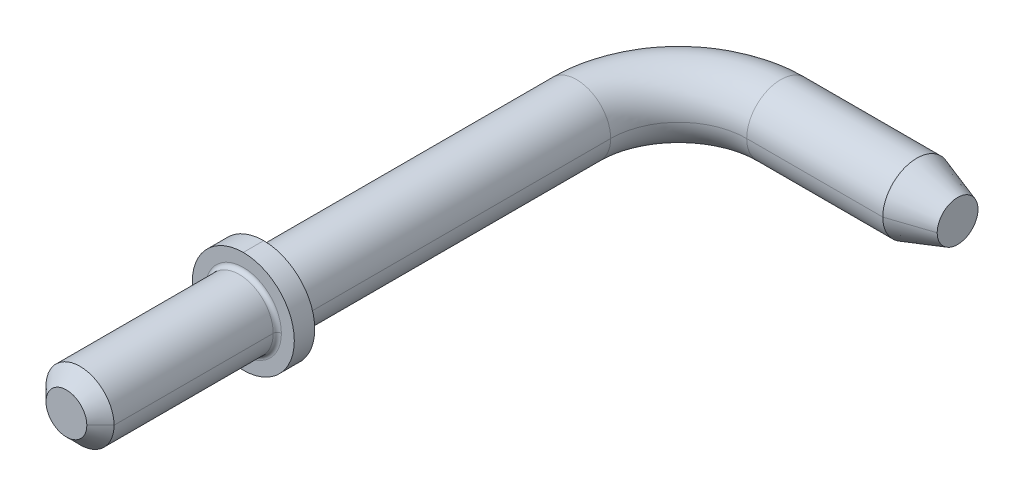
ISO-10303-21;
HEADER;
FILE_DESCRIPTION(('STEP AP214'),'2;1');
FILE_NAME('part.step','',(''),(''),'','','');
FILE_SCHEMA(('AUTOMOTIVE_DESIGN { 1 0 10303 214 1 1 1 1 }'));
ENDSEC;
DATA;
#1=APPLICATION_CONTEXT('core data for automotive mechanical design processes');
#2=APPLICATION_PROTOCOL_DEFINITION('international standard','automotive_design',2000,#1);
#3=PRODUCT_CONTEXT('',#1,'mechanical');
#4=PRODUCT('Part','Part','',(#3));
#5=PRODUCT_RELATED_PRODUCT_CATEGORY('part','',(#4));
#6=PRODUCT_DEFINITION_FORMATION('','',#4);
#7=PRODUCT_DEFINITION_CONTEXT('part definition',#1,'design');
#8=PRODUCT_DEFINITION('design','',#6,#7);
#9=PRODUCT_DEFINITION_SHAPE('','',#8);
#10=(LENGTH_UNIT() NAMED_UNIT(*) SI_UNIT(.MILLI.,.METRE.));
#11=(NAMED_UNIT(*) PLANE_ANGLE_UNIT() SI_UNIT($,.RADIAN.));
#12=(NAMED_UNIT(*) SI_UNIT($,.STERADIAN.) SOLID_ANGLE_UNIT());
#13=UNCERTAINTY_MEASURE_WITH_UNIT(LENGTH_MEASURE(1.E-05),#10,'distance_accuracy_value','');
#14=(GEOMETRIC_REPRESENTATION_CONTEXT(3) GLOBAL_UNCERTAINTY_ASSIGNED_CONTEXT((#13)) GLOBAL_UNIT_ASSIGNED_CONTEXT((#10,
#11,#12)) REPRESENTATION_CONTEXT('',''));
#15=CARTESIAN_POINT('',(0.,0.,0.));
#16=DIRECTION('',(0.,0.,1.));
#17=DIRECTION('',(1.,0.,0.));
#18=AXIS2_PLACEMENT_3D('',#15,#16,#17);
#19=CARTESIAN_POINT('',(0.,0.,14.5));
#20=DIRECTION('',(0.,0.,-1.));
#21=DIRECTION('',(1.,0.,0.));
#22=AXIS2_PLACEMENT_3D('',#19,#20,#21);
#23=PLANE('',#22);
#24=CARTESIAN_POINT('',(0.,0.,14.5000000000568));
#25=DIRECTION('',(0.,0.,-1.));
#26=DIRECTION('',(1.,0.,0.));
#27=AXIS2_PLACEMENT_3D('',#24,#25,#26);
#28=CIRCLE('',#27,1.49999999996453);
#29=CARTESIAN_POINT('',(1.49999999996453,0.,14.5000000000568));
#30=VERTEX_POINT('',#29);
#31=CARTESIAN_POINT('',(-1.49999999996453,0.,14.5000000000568));
#32=VERTEX_POINT('',#31);
#33=EDGE_CURVE('E17',#30,#32,#28,.T.);
#34=ORIENTED_EDGE('',*,*,#33,.F.);
#35=CARTESIAN_POINT('',(0.,0.,14.5000000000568));
#36=DIRECTION('',(0.,0.,-1.));
#37=DIRECTION('',(1.,0.,0.));
#38=AXIS2_PLACEMENT_3D('',#35,#36,#37);
#39=CIRCLE('',#38,1.49999999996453);
#40=EDGE_CURVE('E97',#32,#30,#39,.T.);
#41=ORIENTED_EDGE('',*,*,#40,.F.);
#42=EDGE_LOOP('',(#34,#41));
#43=FACE_BOUND('',#42,.T.);
#44=ADVANCED_FACE('F14',(#43),#23,.F.);
#45=CARTESIAN_POINT('',(0.,0.,13.5000000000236));
#46=DIRECTION('',(0.,0.,-1.));
#47=DIRECTION('',(1.,0.,0.));
#48=AXIS2_PLACEMENT_3D('',#45,#46,#47);
#49=CONICAL_SURFACE('',#48,2.49999999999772,0.785398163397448);
#50=DIRECTION('',(-0.707106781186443,0.,0.707106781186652));
#51=VECTOR('',#50,1.);
#52=CARTESIAN_POINT('',(499000.,0.,-498984.000000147));
#53=LINE('',#52,#51);
#54=CARTESIAN_POINT('',(2.49999999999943,0.,13.5000000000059));
#55=VERTEX_POINT('',#54);
#56=EDGE_CURVE('E95',#30,#55,#53,.F.);
#57=ORIENTED_EDGE('',*,*,#56,.F.);
#58=ORIENTED_EDGE('',*,*,#33,.T.);
#59=DIRECTION('',(0.707106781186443,0.,0.707106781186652));
#60=VECTOR('',#59,1.);
#61=CARTESIAN_POINT('',(-499000.,-6.11078570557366E-11,-498984.000000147));
#62=LINE('',#61,#60);
#63=CARTESIAN_POINT('',(-2.49999999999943,0.,13.5000000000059));
#64=VERTEX_POINT('',#63);
#65=EDGE_CURVE('E92',#64,#32,#62,.T.);
#66=ORIENTED_EDGE('',*,*,#65,.F.);
#67=CARTESIAN_POINT('',(0.,0.,13.5));
#68=DIRECTION('',(0.,0.,-1.));
#69=DIRECTION('',(1.,0.,0.));
#70=AXIS2_PLACEMENT_3D('',#67,#68,#69);
#71=CIRCLE('',#70,2.5);
#72=EDGE_CURVE('E99',#55,#64,#71,.T.);
#73=ORIENTED_EDGE('',*,*,#72,.F.);
#74=EDGE_LOOP('',(#57,#58,#66,#73));
#75=FACE_BOUND('',#74,.T.);
#76=ADVANCED_FACE('F90',(#75),#49,.T.);
#77=CARTESIAN_POINT('',(0.,0.,13.5000000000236));
#78=DIRECTION('',(0.,0.,-1.));
#79=DIRECTION('',(1.,0.,0.));
#80=AXIS2_PLACEMENT_3D('',#77,#78,#79);
#81=CONICAL_SURFACE('',#80,2.49999999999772,0.785398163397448);
#82=ORIENTED_EDGE('',*,*,#65,.T.);
#83=ORIENTED_EDGE('',*,*,#40,.T.);
#84=ORIENTED_EDGE('',*,*,#56,.T.);
#85=CARTESIAN_POINT('',(0.,0.,13.5));
#86=DIRECTION('',(0.,0.,-1.));
#87=DIRECTION('',(1.,0.,0.));
#88=AXIS2_PLACEMENT_3D('',#85,#86,#87);
#89=CIRCLE('',#88,2.5);
#90=EDGE_CURVE('E103',#64,#55,#89,.T.);
#91=ORIENTED_EDGE('',*,*,#90,.F.);
#92=EDGE_LOOP('',(#82,#83,#84,#91));
#93=FACE_BOUND('',#92,.T.);
#94=ADVANCED_FACE('F101',(#93),#81,.T.);
#95=CARTESIAN_POINT('',(0.,0.,14.5));
#96=DIRECTION('',(0.,0.,-1.));
#97=DIRECTION('',(1.,0.,0.));
#98=AXIS2_PLACEMENT_3D('',#95,#96,#97);
#99=CYLINDRICAL_SURFACE('',#98,2.5);
#100=DIRECTION('',(0.,0.,-1.));
#101=VECTOR('',#100,1.);
#102=CARTESIAN_POINT('',(-2.5,0.,14.5));
#103=LINE('',#102,#101);
#104=CARTESIAN_POINT('',(-2.5,0.,1.8));
#105=VERTEX_POINT('',#104);
#106=EDGE_CURVE('E189',#105,#64,#103,.F.);
#107=ORIENTED_EDGE('',*,*,#106,.F.);
#108=CARTESIAN_POINT('',(0.,0.,1.8));
#109=DIRECTION('',(0.,0.,-1.));
#110=DIRECTION('',(0.99939718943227,0.034716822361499,0.));
#111=AXIS2_PLACEMENT_3D('',#108,#109,#110);
#112=CIRCLE('',#111,2.5);
#113=CARTESIAN_POINT('',(2.5,0.,1.8));
#114=VERTEX_POINT('',#113);
#115=EDGE_CURVE('E171',#105,#114,#112,.F.);
#116=ORIENTED_EDGE('',*,*,#115,.T.);
#117=DIRECTION('',(0.,0.,-1.));
#118=VECTOR('',#117,1.);
#119=CARTESIAN_POINT('',(2.5,0.,14.5));
#120=LINE('',#119,#118);
#121=EDGE_CURVE('E178',#55,#114,#120,.T.);
#122=ORIENTED_EDGE('',*,*,#121,.F.);
#123=ORIENTED_EDGE('',*,*,#72,.T.);
#124=EDGE_LOOP('',(#107,#116,#122,#123));
#125=FACE_BOUND('',#124,.T.);
#126=ADVANCED_FACE('F201',(#125),#99,.T.);
#127=CARTESIAN_POINT('',(0.,0.,14.5));
#128=DIRECTION('',(0.,0.,-1.));
#129=DIRECTION('',(1.,0.,0.));
#130=AXIS2_PLACEMENT_3D('',#127,#128,#129);
#131=CYLINDRICAL_SURFACE('',#130,2.5);
#132=ORIENTED_EDGE('',*,*,#121,.T.);
#133=CARTESIAN_POINT('',(0.,0.,1.8));
#134=DIRECTION('',(0.,0.,-1.));
#135=DIRECTION('',(-0.99939718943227,-0.034716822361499,0.));
#136=AXIS2_PLACEMENT_3D('',#133,#134,#135);
#137=CIRCLE('',#136,2.5);
#138=EDGE_CURVE('E146',#114,#105,#137,.F.);
#139=ORIENTED_EDGE('',*,*,#138,.T.);
#140=ORIENTED_EDGE('',*,*,#106,.T.);
#141=ORIENTED_EDGE('',*,*,#90,.T.);
#142=EDGE_LOOP('',(#132,#139,#140,#141));
#143=FACE_BOUND('',#142,.T.);
#144=ADVANCED_FACE('F163',(#143),#131,.T.);
#145=CARTESIAN_POINT('',(0.,0.,1.8));
#146=DIRECTION('',(0.,0.,-1.));
#147=DIRECTION('',(0.99939718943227,0.034716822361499,0.));
#148=AXIS2_PLACEMENT_3D('',#145,#146,#147);
#149=TOROIDAL_SURFACE('',#148,2.8,0.3);
#150=CARTESIAN_POINT('',(0.,0.,1.50000000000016));
#151=DIRECTION('',(0.,0.,1.));
#152=DIRECTION('',(-1.,0.,0.));
#153=AXIS2_PLACEMENT_3D('',#150,#151,#152);
#154=CIRCLE('',#153,2.7999996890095);
#155=CARTESIAN_POINT('',(2.7999995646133,0.,1.5000000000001));
#156=VERTEX_POINT('',#155);
#157=CARTESIAN_POINT('',(-2.7999995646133,0.,1.5000000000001));
#158=VERTEX_POINT('',#157);
#159=EDGE_CURVE('E132',#156,#158,#154,.F.);
#160=ORIENTED_EDGE('',*,*,#159,.F.);
#161=CARTESIAN_POINT('',(2.8,0.,1.8));
#162=DIRECTION('',(0.,-1.,0.));
#163=DIRECTION('',(1.,0.,0.));
#164=AXIS2_PLACEMENT_3D('',#161,#162,#163);
#165=CIRCLE('',#164,0.3);
#166=EDGE_CURVE('E133',#156,#114,#165,.F.);
#167=ORIENTED_EDGE('',*,*,#166,.T.);
#168=ORIENTED_EDGE('',*,*,#115,.F.);
#169=CARTESIAN_POINT('',(-2.8,0.,1.8));
#170=DIRECTION('',(0.,1.,0.));
#171=DIRECTION('',(-1.,0.,0.));
#172=AXIS2_PLACEMENT_3D('',#169,#170,#171);
#173=CIRCLE('',#172,0.3);
#174=EDGE_CURVE('E140',#105,#158,#173,.T.);
#175=ORIENTED_EDGE('',*,*,#174,.T.);
#176=EDGE_LOOP('',(#160,#167,#168,#175));
#177=FACE_BOUND('',#176,.T.);
#178=ADVANCED_FACE('F157',(#177),#149,.F.);
#179=CARTESIAN_POINT('',(0.,0.,1.8));
#180=DIRECTION('',(0.,0.,-1.));
#181=DIRECTION('',(-0.99939718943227,-0.034716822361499,0.));
#182=AXIS2_PLACEMENT_3D('',#179,#180,#181);
#183=TOROIDAL_SURFACE('',#182,2.8,0.3);
#184=CARTESIAN_POINT('',(0.,0.,1.50000000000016));
#185=DIRECTION('',(0.,0.,1.));
#186=DIRECTION('',(1.,0.,0.));
#187=AXIS2_PLACEMENT_3D('',#184,#185,#186);
#188=CIRCLE('',#187,2.7999996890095);
#189=EDGE_CURVE('E138',#158,#156,#188,.F.);
#190=ORIENTED_EDGE('',*,*,#189,.F.);
#191=ORIENTED_EDGE('',*,*,#174,.F.);
#192=ORIENTED_EDGE('',*,*,#138,.F.);
#193=ORIENTED_EDGE('',*,*,#166,.F.);
#194=EDGE_LOOP('',(#190,#191,#192,#193));
#195=FACE_BOUND('',#194,.T.);
#196=ADVANCED_FACE('F162',(#195),#183,.F.);
#197=CARTESIAN_POINT('',(20.5,0.,-30.499999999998));
#198=DIRECTION('',(1.,0.,0.));
#199=DIRECTION('',(0.,1.,0.));
#200=AXIS2_PLACEMENT_3D('',#197,#198,#199);
#201=PLANE('',#200);
#202=CARTESIAN_POINT('',(20.49999999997,0.,-30.499999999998));
#203=DIRECTION('',(-1.,0.,0.));
#204=DIRECTION('',(0.,-1.,0.));
#205=AXIS2_PLACEMENT_3D('',#202,#203,#204);
#206=CIRCLE('',#205,1.50000000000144);
#207=CARTESIAN_POINT('',(20.49999999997,0.,-28.9999999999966));
#208=VERTEX_POINT('',#207);
#209=CARTESIAN_POINT('',(20.49999999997,0.,-32.0000000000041));
#210=VERTEX_POINT('',#209);
#211=EDGE_CURVE('E127',#208,#210,#206,.T.);
#212=ORIENTED_EDGE('',*,*,#211,.F.);
#213=CARTESIAN_POINT('',(20.49999999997,0.,-30.499999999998));
#214=DIRECTION('',(-1.,0.,0.));
#215=DIRECTION('',(0.,-1.,0.));
#216=AXIS2_PLACEMENT_3D('',#213,#214,#215);
#217=CIRCLE('',#216,1.50000000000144);
#218=EDGE_CURVE('E131',#210,#208,#217,.T.);
#219=ORIENTED_EDGE('',*,*,#218,.F.);
#220=EDGE_LOOP('',(#212,#219));
#221=FACE_BOUND('',#220,.T.);
#222=ADVANCED_FACE('F446',(#221),#201,.T.);
#223=CARTESIAN_POINT('',(17.5000000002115,0.,-30.499999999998));
#224=DIRECTION('',(-1.,0.,0.));
#225=DIRECTION('',(0.,-1.,0.));
#226=AXIS2_PLACEMENT_3D('',#223,#224,#225);
#227=CONICAL_SURFACE('',#226,2.49999999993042,0.321750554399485);
#228=DIRECTION('',(0.948683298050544,0.,0.316227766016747));
#229=VECTOR('',#228,1.);
#230=CARTESIAN_POINT('',(-499000.,0.,-166372.166666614));
#231=LINE('',#230,#229);
#232=CARTESIAN_POINT('',(17.5000000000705,0.,-32.9999999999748));
#233=VERTEX_POINT('',#232);
#234=EDGE_CURVE('E209',#210,#233,#231,.F.);
#235=ORIENTED_EDGE('',*,*,#234,.F.);
#236=ORIENTED_EDGE('',*,*,#218,.T.);
#237=DIRECTION('',(0.948683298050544,0.,-0.316227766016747));
#238=VECTOR('',#237,1.);
#239=CARTESIAN_POINT('',(-499000.,-2.03703061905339E-11,166311.166666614));
#240=LINE('',#239,#238);
#241=CARTESIAN_POINT('',(17.5000000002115,0.,-28.0000000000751));
#242=VERTEX_POINT('',#241);
#243=EDGE_CURVE('E130',#242,#208,#240,.T.);
#244=ORIENTED_EDGE('',*,*,#243,.F.);
#245=CARTESIAN_POINT('',(17.5,0.,-30.499999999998));
#246=DIRECTION('',(1.,0.,0.));
#247=DIRECTION('',(0.,1.,0.));
#248=AXIS2_PLACEMENT_3D('',#245,#246,#247);
#249=CIRCLE('',#248,2.5);
#250=EDGE_CURVE('E126',#233,#242,#249,.F.);
#251=ORIENTED_EDGE('',*,*,#250,.F.);
#252=EDGE_LOOP('',(#235,#236,#244,#251));
#253=FACE_BOUND('',#252,.T.);
#254=ADVANCED_FACE('F232',(#253),#227,.T.);
#255=CARTESIAN_POINT('',(0.,0.,1.5));
#256=DIRECTION('',(0.,0.,1.));
#257=DIRECTION('',(-1.,0.,0.));
#258=AXIS2_PLACEMENT_3D('',#255,#256,#257);
#259=PLANE('',#258);
#260=ORIENTED_EDGE('',*,*,#159,.T.);
#261=ORIENTED_EDGE('',*,*,#189,.T.);
#262=EDGE_LOOP('',(#260,#261));
#263=FACE_BOUND('',#262,.T.);
#264=CARTESIAN_POINT('',(0.,0.,1.5));
#265=DIRECTION('',(0.,0.,1.));
#266=DIRECTION('',(-1.,0.,0.));
#267=AXIS2_PLACEMENT_3D('',#264,#265,#266);
#268=CIRCLE('',#267,3.75);
#269=CARTESIAN_POINT('',(0.,3.75,1.5));
#270=VERTEX_POINT('',#269);
#271=CARTESIAN_POINT('',(0.,-3.75,1.5));
#272=VERTEX_POINT('',#271);
#273=EDGE_CURVE('E124',#270,#272,#268,.F.);
#274=ORIENTED_EDGE('',*,*,#273,.F.);
#275=CARTESIAN_POINT('',(0.,0.,1.5));
#276=DIRECTION('',(0.,0.,1.));
#277=DIRECTION('',(-1.,0.,0.));
#278=AXIS2_PLACEMENT_3D('',#275,#276,#277);
#279=CIRCLE('',#278,3.75);
#280=EDGE_CURVE('E119',#272,#270,#279,.F.);
#281=ORIENTED_EDGE('',*,*,#280,.F.);
#282=EDGE_LOOP('',(#274,#281));
#283=FACE_BOUND('',#282,.T.);
#284=ADVANCED_FACE('F212',(#263,#283),#259,.T.);
#285=CARTESIAN_POINT('',(17.5000000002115,0.,-30.499999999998));
#286=DIRECTION('',(-1.,0.,0.));
#287=DIRECTION('',(0.,-1.,0.));
#288=AXIS2_PLACEMENT_3D('',#285,#286,#287);
#289=CONICAL_SURFACE('',#288,2.49999999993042,0.321750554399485);
#290=ORIENTED_EDGE('',*,*,#243,.T.);
#291=ORIENTED_EDGE('',*,*,#211,.T.);
#292=ORIENTED_EDGE('',*,*,#234,.T.);
#293=CARTESIAN_POINT('',(17.5,0.,-30.499999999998));
#294=DIRECTION('',(1.,0.,0.));
#295=DIRECTION('',(0.,1.,0.));
#296=AXIS2_PLACEMENT_3D('',#293,#294,#295);
#297=CIRCLE('',#296,2.5);
#298=EDGE_CURVE('E255',#242,#233,#297,.F.);
#299=ORIENTED_EDGE('',*,*,#298,.F.);
#300=EDGE_LOOP('',(#290,#291,#292,#299));
#301=FACE_BOUND('',#300,.T.);
#302=ADVANCED_FACE('F231',(#301),#289,.T.);
#303=CARTESIAN_POINT('',(7.5,0.,-30.499999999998));
#304=DIRECTION('',(1.,0.,0.));
#305=DIRECTION('',(0.,1.,0.));
#306=AXIS2_PLACEMENT_3D('',#303,#304,#305);
#307=CYLINDRICAL_SURFACE('',#306,2.5);
#308=DIRECTION('',(1.,0.,0.));
#309=VECTOR('',#308,1.);
#310=CARTESIAN_POINT('',(7.5,0.,-27.999999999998));
#311=LINE('',#310,#309);
#312=CARTESIAN_POINT('',(7.5,0.,-27.999999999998));
#313=VERTEX_POINT('',#312);
#314=EDGE_CURVE('E259',#313,#242,#311,.T.);
#315=ORIENTED_EDGE('',*,*,#314,.F.);
#316=CARTESIAN_POINT('',(7.5,0.,-30.499999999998));
#317=DIRECTION('',(1.,0.,0.));
#318=DIRECTION('',(0.,0.,-1.));
#319=AXIS2_PLACEMENT_3D('',#316,#317,#318);
#320=CIRCLE('',#319,2.5);
#321=CARTESIAN_POINT('',(7.5,0.,-32.999999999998));
#322=VERTEX_POINT('',#321);
#323=EDGE_CURVE('E268',#322,#313,#320,.F.);
#324=ORIENTED_EDGE('',*,*,#323,.F.);
#325=DIRECTION('',(1.,0.,0.));
#326=VECTOR('',#325,1.);
#327=CARTESIAN_POINT('',(7.5,0.,-32.999999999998));
#328=LINE('',#327,#326);
#329=EDGE_CURVE('E258',#233,#322,#328,.F.);
#330=ORIENTED_EDGE('',*,*,#329,.F.);
#331=ORIENTED_EDGE('',*,*,#250,.T.);
#332=EDGE_LOOP('',(#315,#324,#330,#331));
#333=FACE_BOUND('',#332,.T.);
#334=ADVANCED_FACE('F396',(#333),#307,.T.);
#335=CARTESIAN_POINT('',(0.,0.,-0.0750000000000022));
#336=DIRECTION('',(0.,0.,1.));
#337=DIRECTION('',(-1.,0.,0.));
#338=AXIS2_PLACEMENT_3D('',#335,#336,#337);
#339=CYLINDRICAL_SURFACE('',#338,3.75);
#340=CARTESIAN_POINT('',(0.,0.,0.));
#341=DIRECTION('',(0.,0.,1.));
#342=DIRECTION('',(-1.,0.,0.));
#343=AXIS2_PLACEMENT_3D('',#340,#341,#342);
#344=CIRCLE('',#343,3.75);
#345=CARTESIAN_POINT('',(0.,-3.75,0.));
#346=VERTEX_POINT('',#345);
#347=CARTESIAN_POINT('',(0.,3.75,0.));
#348=VERTEX_POINT('',#347);
#349=EDGE_CURVE('E116',#346,#348,#344,.T.);
#350=ORIENTED_EDGE('',*,*,#349,.T.);
#351=DIRECTION('',(0.,0.,1.));
#352=VECTOR('',#351,1.);
#353=CARTESIAN_POINT('',(0.,3.75,-0.0750000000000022));
#354=LINE('',#353,#352);
#355=EDGE_CURVE('E122',#270,#348,#354,.F.);
#356=ORIENTED_EDGE('',*,*,#355,.F.);
#357=ORIENTED_EDGE('',*,*,#273,.T.);
#358=DIRECTION('',(0.,0.,1.));
#359=VECTOR('',#358,1.);
#360=CARTESIAN_POINT('',(0.,-3.75,-0.0750000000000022));
#361=LINE('',#360,#359);
#362=EDGE_CURVE('E123',#346,#272,#361,.T.);
#363=ORIENTED_EDGE('',*,*,#362,.F.);
#364=EDGE_LOOP('',(#350,#356,#357,#363));
#365=FACE_BOUND('',#364,.T.);
#366=ADVANCED_FACE('F424',(#365),#339,.T.);
#367=CARTESIAN_POINT('',(0.,0.,-0.0750000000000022));
#368=DIRECTION('',(0.,0.,1.));
#369=DIRECTION('',(-1.,0.,0.));
#370=AXIS2_PLACEMENT_3D('',#367,#368,#369);
#371=CYLINDRICAL_SURFACE('',#370,3.75);
#372=ORIENTED_EDGE('',*,*,#280,.T.);
#373=ORIENTED_EDGE('',*,*,#355,.T.);
#374=CARTESIAN_POINT('',(0.,0.,0.));
#375=DIRECTION('',(0.,0.,1.));
#376=DIRECTION('',(-1.,0.,0.));
#377=AXIS2_PLACEMENT_3D('',#374,#375,#376);
#378=CIRCLE('',#377,3.75);
#379=EDGE_CURVE('E112',#348,#346,#378,.T.);
#380=ORIENTED_EDGE('',*,*,#379,.T.);
#381=ORIENTED_EDGE('',*,*,#362,.T.);
#382=EDGE_LOOP('',(#372,#373,#380,#381));
#383=FACE_BOUND('',#382,.T.);
#384=ADVANCED_FACE('F426',(#383),#371,.T.);
#385=CARTESIAN_POINT('',(7.5,0.,-30.499999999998));
#386=DIRECTION('',(1.,0.,0.));
#387=DIRECTION('',(0.,1.,0.));
#388=AXIS2_PLACEMENT_3D('',#385,#386,#387);
#389=CYLINDRICAL_SURFACE('',#388,2.5);
#390=ORIENTED_EDGE('',*,*,#329,.T.);
#391=CARTESIAN_POINT('',(7.5,0.,-30.499999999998));
#392=DIRECTION('',(1.,0.,0.));
#393=DIRECTION('',(0.,0.,-1.));
#394=AXIS2_PLACEMENT_3D('',#391,#392,#393);
#395=CIRCLE('',#394,2.5);
#396=EDGE_CURVE('E400',#313,#322,#395,.F.);
#397=ORIENTED_EDGE('',*,*,#396,.F.);
#398=ORIENTED_EDGE('',*,*,#314,.T.);
#399=ORIENTED_EDGE('',*,*,#298,.T.);
#400=EDGE_LOOP('',(#390,#397,#398,#399));
#401=FACE_BOUND('',#400,.T.);
#402=ADVANCED_FACE('F398',(#401),#389,.T.);
#403=CARTESIAN_POINT('',(7.5,0.,-22.999999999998));
#404=DIRECTION('',(0.,-1.,0.));
#405=DIRECTION('',(1.,0.,0.));
#406=AXIS2_PLACEMENT_3D('',#403,#404,#405);
#407=TOROIDAL_SURFACE('',#406,7.5,2.5);
#408=CARTESIAN_POINT('',(7.5,0.,-22.999999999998));
#409=DIRECTION('',(0.,-1.,0.));
#410=DIRECTION('',(1.,0.,0.));
#411=AXIS2_PLACEMENT_3D('',#408,#409,#410);
#412=CIRCLE('',#411,5.);
#413=CARTESIAN_POINT('',(2.5,0.,-22.999999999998));
#414=VERTEX_POINT('',#413);
#415=EDGE_CURVE('E391',#414,#313,#412,.T.);
#416=ORIENTED_EDGE('',*,*,#415,.F.);
#417=CARTESIAN_POINT('',(0.,0.,-22.999999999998));
#418=DIRECTION('',(0.,0.,-1.));
#419=DIRECTION('',(1.,0.,0.));
#420=AXIS2_PLACEMENT_3D('',#417,#418,#419);
#421=CIRCLE('',#420,2.5);
#422=CARTESIAN_POINT('',(-2.5,0.,-22.999999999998));
#423=VERTEX_POINT('',#422);
#424=EDGE_CURVE('E335',#423,#414,#421,.F.);
#425=ORIENTED_EDGE('',*,*,#424,.F.);
#426=CARTESIAN_POINT('',(7.5,0.,-22.999999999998));
#427=DIRECTION('',(0.,-1.,0.));
#428=DIRECTION('',(1.,0.,0.));
#429=AXIS2_PLACEMENT_3D('',#426,#427,#428);
#430=CIRCLE('',#429,10.);
#431=EDGE_CURVE('E339',#322,#423,#430,.F.);
#432=ORIENTED_EDGE('',*,*,#431,.F.);
#433=ORIENTED_EDGE('',*,*,#323,.T.);
#434=EDGE_LOOP('',(#416,#425,#432,#433));
#435=FACE_BOUND('',#434,.T.);
#436=ADVANCED_FACE('F305',(#435),#407,.T.);
#437=CARTESIAN_POINT('',(0.,0.,-0.6));
#438=DIRECTION('',(0.,0.,-1.));
#439=DIRECTION('',(-0.999492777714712,0.0318463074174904,0.));
#440=AXIS2_PLACEMENT_3D('',#437,#438,#439);
#441=TOROIDAL_SURFACE('',#440,3.1,0.6);
#442=CARTESIAN_POINT('',(0.,0.,-1.85723832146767E-13));
#443=DIRECTION('',(0.,0.,-1.));
#444=DIRECTION('',(1.,0.,0.));
#445=AXIS2_PLACEMENT_3D('',#442,#443,#444);
#446=CIRCLE('',#445,3.0999995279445);
#447=CARTESIAN_POINT('',(3.0999993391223,0.,0.));
#448=VERTEX_POINT('',#447);
#449=CARTESIAN_POINT('',(-3.0999993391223,0.,0.));
#450=VERTEX_POINT('',#449);
#451=EDGE_CURVE('E115',#448,#450,#446,.T.);
#452=ORIENTED_EDGE('',*,*,#451,.T.);
#453=CARTESIAN_POINT('',(-3.1,0.,-0.6));
#454=DIRECTION('',(0.,1.,0.));
#455=DIRECTION('',(-1.,0.,0.));
#456=AXIS2_PLACEMENT_3D('',#453,#454,#455);
#457=CIRCLE('',#456,0.6);
#458=CARTESIAN_POINT('',(-2.5,0.,-0.6));
#459=VERTEX_POINT('',#458);
#460=EDGE_CURVE('E32',#459,#450,#457,.F.);
#461=ORIENTED_EDGE('',*,*,#460,.F.);
#462=CARTESIAN_POINT('',(0.,0.,-0.6));
#463=DIRECTION('',(0.,0.,-1.));
#464=DIRECTION('',(1.,0.,0.));
#465=AXIS2_PLACEMENT_3D('',#462,#463,#464);
#466=CIRCLE('',#465,2.5);
#467=CARTESIAN_POINT('',(2.5,0.,-0.6));
#468=VERTEX_POINT('',#467);
#469=EDGE_CURVE('E338',#468,#459,#466,.T.);
#470=ORIENTED_EDGE('',*,*,#469,.F.);
#471=CARTESIAN_POINT('',(3.1,0.,-0.6));
#472=DIRECTION('',(0.,-1.,0.));
#473=DIRECTION('',(1.,0.,0.));
#474=AXIS2_PLACEMENT_3D('',#471,#472,#473);
#475=CIRCLE('',#474,0.6);
#476=EDGE_CURVE('E118',#448,#468,#475,.T.);
#477=ORIENTED_EDGE('',*,*,#476,.F.);
#478=EDGE_LOOP('',(#452,#461,#470,#477));
#479=FACE_BOUND('',#478,.T.);
#480=ADVANCED_FACE('F294',(#479),#441,.F.);
#481=CARTESIAN_POINT('',(0.,0.,0.));
#482=DIRECTION('',(0.,0.,1.));
#483=DIRECTION('',(-1.,0.,0.));
#484=AXIS2_PLACEMENT_3D('',#481,#482,#483);
#485=PLANE('',#484);
#486=CARTESIAN_POINT('',(0.,0.,-1.85723832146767E-13));
#487=DIRECTION('',(0.,0.,-1.));
#488=DIRECTION('',(-1.,0.,0.));
#489=AXIS2_PLACEMENT_3D('',#486,#487,#488);
#490=CIRCLE('',#489,3.0999995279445);
#491=EDGE_CURVE('E374',#448,#450,#490,.F.);
#492=ORIENTED_EDGE('',*,*,#491,.T.);
#493=ORIENTED_EDGE('',*,*,#451,.F.);
#494=EDGE_LOOP('',(#492,#493));
#495=FACE_BOUND('',#494,.T.);
#496=ORIENTED_EDGE('',*,*,#349,.F.);
#497=ORIENTED_EDGE('',*,*,#379,.F.);
#498=EDGE_LOOP('',(#496,#497));
#499=FACE_BOUND('',#498,.T.);
#500=ADVANCED_FACE('F304',(#495,#499),#485,.F.);
#501=CARTESIAN_POINT('',(7.5,0.,-22.999999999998));
#502=DIRECTION('',(0.,-1.,0.));
#503=DIRECTION('',(1.,0.,0.));
#504=AXIS2_PLACEMENT_3D('',#501,#502,#503);
#505=TOROIDAL_SURFACE('',#504,7.5,2.5);
#506=ORIENTED_EDGE('',*,*,#431,.T.);
#507=CARTESIAN_POINT('',(0.,0.,-22.999999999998));
#508=DIRECTION('',(0.,0.,-1.));
#509=DIRECTION('',(1.,0.,0.));
#510=AXIS2_PLACEMENT_3D('',#507,#508,#509);
#511=CIRCLE('',#510,2.5);
#512=EDGE_CURVE('E334',#414,#423,#511,.F.);
#513=ORIENTED_EDGE('',*,*,#512,.F.);
#514=ORIENTED_EDGE('',*,*,#415,.T.);
#515=ORIENTED_EDGE('',*,*,#396,.T.);
#516=EDGE_LOOP('',(#506,#513,#514,#515));
#517=FACE_BOUND('',#516,.T.);
#518=ADVANCED_FACE('F343',(#517),#505,.T.);
#519=CARTESIAN_POINT('',(0.,0.,14.5));
#520=DIRECTION('',(0.,0.,-1.));
#521=DIRECTION('',(1.,0.,0.));
#522=AXIS2_PLACEMENT_3D('',#519,#520,#521);
#523=CYLINDRICAL_SURFACE('',#522,2.5);
#524=DIRECTION('',(0.,0.,-1.));
#525=VECTOR('',#524,1.);
#526=CARTESIAN_POINT('',(2.5,0.,14.5));
#527=LINE('',#526,#525);
#528=EDGE_CURVE('E367',#468,#414,#527,.T.);
#529=ORIENTED_EDGE('',*,*,#528,.F.);
#530=ORIENTED_EDGE('',*,*,#469,.T.);
#531=DIRECTION('',(0.,0.,-1.));
#532=VECTOR('',#531,1.);
#533=CARTESIAN_POINT('',(-2.5,0.,14.5));
#534=LINE('',#533,#532);
#535=EDGE_CURVE('E23',#423,#459,#534,.F.);
#536=ORIENTED_EDGE('',*,*,#535,.F.);
#537=ORIENTED_EDGE('',*,*,#424,.T.);
#538=EDGE_LOOP('',(#529,#530,#536,#537));
#539=FACE_BOUND('',#538,.T.);
#540=ADVANCED_FACE('F329',(#539),#523,.T.);
#541=CARTESIAN_POINT('',(0.,0.,-0.6));
#542=DIRECTION('',(0.,0.,-1.));
#543=DIRECTION('',(0.999492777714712,-0.0318463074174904,0.));
#544=AXIS2_PLACEMENT_3D('',#541,#542,#543);
#545=TOROIDAL_SURFACE('',#544,3.1,0.6);
#546=ORIENTED_EDGE('',*,*,#491,.F.);
#547=ORIENTED_EDGE('',*,*,#476,.T.);
#548=CARTESIAN_POINT('',(0.,0.,-0.6));
#549=DIRECTION('',(0.,0.,-1.));
#550=DIRECTION('',(1.,0.,0.));
#551=AXIS2_PLACEMENT_3D('',#548,#549,#550);
#552=CIRCLE('',#551,2.5);
#553=EDGE_CURVE('E9',#459,#468,#552,.T.);
#554=ORIENTED_EDGE('',*,*,#553,.F.);
#555=ORIENTED_EDGE('',*,*,#460,.T.);
#556=EDGE_LOOP('',(#546,#547,#554,#555));
#557=FACE_BOUND('',#556,.T.);
#558=ADVANCED_FACE('F317',(#557),#545,.F.);
#559=CARTESIAN_POINT('',(0.,0.,14.5));
#560=DIRECTION('',(0.,0.,-1.));
#561=DIRECTION('',(1.,0.,0.));
#562=AXIS2_PLACEMENT_3D('',#559,#560,#561);
#563=CYLINDRICAL_SURFACE('',#562,2.5);
#564=ORIENTED_EDGE('',*,*,#535,.T.);
#565=ORIENTED_EDGE('',*,*,#553,.T.);
#566=ORIENTED_EDGE('',*,*,#528,.T.);
#567=ORIENTED_EDGE('',*,*,#512,.T.);
#568=EDGE_LOOP('',(#564,#565,#566,#567));
#569=FACE_BOUND('',#568,.T.);
#570=ADVANCED_FACE('F328',(#569),#563,.T.);
#571=CLOSED_SHELL('',(#44,#76,#94,#126,#144,#178,#196,#222,#254,#284,#302,#334,#366,#384,#402,
#436,#480,#500,#518,#540,#558,#570));
#572=MANIFOLD_SOLID_BREP('B1',#571);
#573=ADVANCED_BREP_SHAPE_REPRESENTATION('',(#18,#572),#14);
#574=SHAPE_DEFINITION_REPRESENTATION(#9,#573);
ENDSEC;
END-ISO-10303-21;
